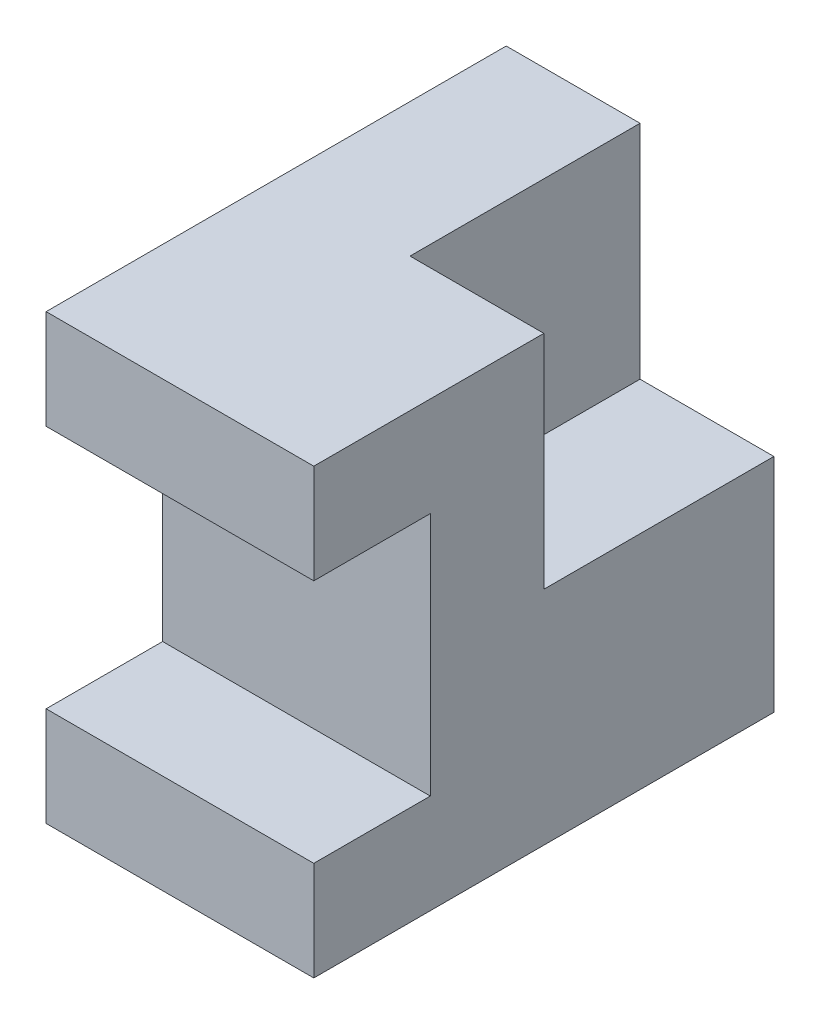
from build123d import *

# Parameters (mm, degrees)
AUFSATZ_LINEAR_AUSTRAGEN1_DEPTH = 30
SKIZZE2_W                       = 30
SKIZZE2_H                       = 51.567181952
SCHNITT_LINEAR_AUSTRAGEN1_DEPTH = 55.77235913


with BuildPart() as part:
    # Skizze1 → Aufsatz-Linear austragen1 (new body)
    with BuildSketch(Plane(origin=(0, 0, 0), x_dir=(0, 0, -1), z_dir=(1, 0, 0))):
        Polygon((-13.057916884, 13.709104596), (-13.057916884, 24.840447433), (38.509265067, 24.840447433), (38.509265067, -24.840447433), (-13.057916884, -24.840447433), (-13.057916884, -13.709104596), (0, -13.709104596), (0, 13.709104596), align=None)
    extrude(amount=-AUFSATZ_LINEAR_AUSTRAGEN1_DEPTH)

    # Skizze2 → Schnitt-Linear austragen1 (cut, through all)
    with BuildSketch(Plane(origin=(0, 0, 0), x_dir=(1, 0, 0), z_dir=(0, 1, 0))):
        with Locations((0, 38.509265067)):
            Rectangle(SKIZZE2_W, SKIZZE2_H)
    extrude(amount=SCHNITT_LINEAR_AUSTRAGEN1_DEPTH, mode=Mode.SUBTRACT)


solid = part.part
